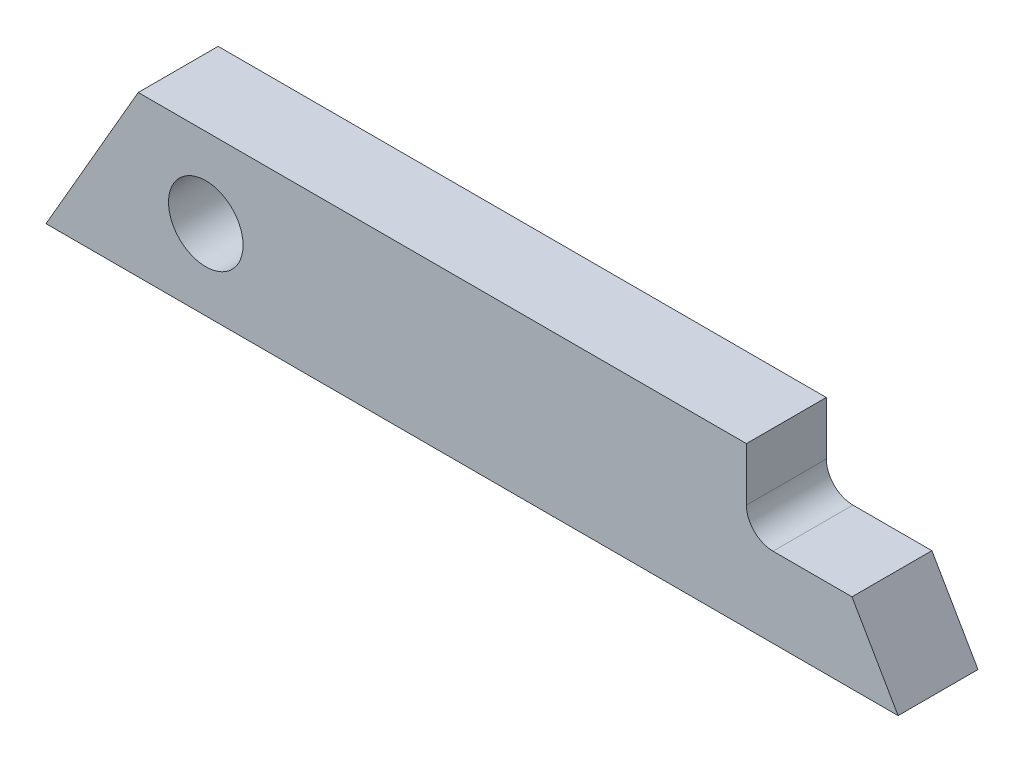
ISO-10303-21;
HEADER;
FILE_DESCRIPTION(('STEP AP214'),'2;1');
FILE_NAME('part.step','',(''),(''),'','','');
FILE_SCHEMA(('AUTOMOTIVE_DESIGN { 1 0 10303 214 1 1 1 1 }'));
ENDSEC;
DATA;
#1=APPLICATION_CONTEXT('core data for automotive mechanical design processes');
#2=APPLICATION_PROTOCOL_DEFINITION('international standard','automotive_design',2000,#1);
#3=PRODUCT_CONTEXT('',#1,'mechanical');
#4=PRODUCT('Part','Part','',(#3));
#5=PRODUCT_RELATED_PRODUCT_CATEGORY('part','',(#4));
#6=PRODUCT_DEFINITION_FORMATION('','',#4);
#7=PRODUCT_DEFINITION_CONTEXT('part definition',#1,'design');
#8=PRODUCT_DEFINITION('design','',#6,#7);
#9=PRODUCT_DEFINITION_SHAPE('','',#8);
#10=(LENGTH_UNIT() NAMED_UNIT(*) SI_UNIT(.MILLI.,.METRE.));
#11=(NAMED_UNIT(*) PLANE_ANGLE_UNIT() SI_UNIT($,.RADIAN.));
#12=(NAMED_UNIT(*) SI_UNIT($,.STERADIAN.) SOLID_ANGLE_UNIT());
#13=UNCERTAINTY_MEASURE_WITH_UNIT(LENGTH_MEASURE(1.E-05),#10,'distance_accuracy_value','');
#14=(GEOMETRIC_REPRESENTATION_CONTEXT(3) GLOBAL_UNCERTAINTY_ASSIGNED_CONTEXT((#13)) GLOBAL_UNIT_ASSIGNED_CONTEXT((#10,
#11,#12)) REPRESENTATION_CONTEXT('',''));
#15=CARTESIAN_POINT('',(0.,0.,0.));
#16=DIRECTION('',(0.,0.,1.));
#17=DIRECTION('',(1.,0.,0.));
#18=AXIS2_PLACEMENT_3D('',#15,#16,#17);
#19=CARTESIAN_POINT('',(80.,15.,15.));
#20=DIRECTION('',(0.,1.,0.));
#21=DIRECTION('',(0.,0.,1.));
#22=AXIS2_PLACEMENT_3D('',#19,#20,#21);
#23=PLANE('',#22);
#24=DIRECTION('',(1.,0.,0.));
#25=VECTOR('',#24,1.);
#26=CARTESIAN_POINT('',(80.,15.,0.));
#27=LINE('',#26,#25);
#28=CARTESIAN_POINT('',(136.514794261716,15.,0.));
#29=VERTEX_POINT('',#28);
#30=CARTESIAN_POINT('',(151.339745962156,15.,0.));
#31=VERTEX_POINT('',#30);
#32=EDGE_CURVE('E122',#29,#31,#27,.T.);
#33=ORIENTED_EDGE('',*,*,#32,.F.);
#34=DIRECTION('',(0.,0.,-1.));
#35=VECTOR('',#34,1.);
#36=CARTESIAN_POINT('',(136.514794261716,15.,15.));
#37=LINE('',#36,#35);
#38=CARTESIAN_POINT('',(136.514794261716,15.,15.));
#39=VERTEX_POINT('',#38);
#40=EDGE_CURVE('E11',#39,#29,#37,.T.);
#41=ORIENTED_EDGE('',*,*,#40,.F.);
#42=DIRECTION('',(1.,0.,0.));
#43=VECTOR('',#42,1.);
#44=CARTESIAN_POINT('',(80.,15.,15.));
#45=LINE('',#44,#43);
#46=CARTESIAN_POINT('',(151.339745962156,15.,15.));
#47=VERTEX_POINT('',#46);
#48=EDGE_CURVE('E140',#39,#47,#45,.T.);
#49=ORIENTED_EDGE('',*,*,#48,.T.);
#50=DIRECTION('',(0.,0.,-1.));
#51=VECTOR('',#50,1.);
#52=CARTESIAN_POINT('',(151.339745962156,15.,15.));
#53=LINE('',#52,#51);
#54=EDGE_CURVE('E82',#47,#31,#53,.T.);
#55=ORIENTED_EDGE('',*,*,#54,.T.);
#56=EDGE_LOOP('',(#33,#41,#49,#55));
#57=FACE_BOUND('',#56,.T.);
#58=ADVANCED_FACE('F35',(#57),#23,.T.);
#59=CARTESIAN_POINT('',(136.514794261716,20.0000000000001,15.));
#60=DIRECTION('',(0.,0.,-1.));
#61=DIRECTION('',(-1.,0.,0.));
#62=AXIS2_PLACEMENT_3D('',#59,#60,#61);
#63=CYLINDRICAL_SURFACE('',#62,5.00000000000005);
#64=CARTESIAN_POINT('',(136.514794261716,20.0000000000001,0.));
#65=DIRECTION('',(0.,0.,1.));
#66=DIRECTION('',(1.,0.,0.));
#67=AXIS2_PLACEMENT_3D('',#64,#65,#66);
#68=CIRCLE('',#67,5.00000000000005);
#69=CARTESIAN_POINT('',(131.514794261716,20.0000000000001,0.));
#70=VERTEX_POINT('',#69);
#71=EDGE_CURVE('E125',#70,#29,#68,.T.);
#72=ORIENTED_EDGE('',*,*,#71,.F.);
#73=DIRECTION('',(0.,0.,-1.));
#74=VECTOR('',#73,1.);
#75=CARTESIAN_POINT('',(131.514794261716,20.0000000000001,15.));
#76=LINE('',#75,#74);
#77=CARTESIAN_POINT('',(131.514794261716,20.0000000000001,15.));
#78=VERTEX_POINT('',#77);
#79=EDGE_CURVE('E43',#78,#70,#76,.T.);
#80=ORIENTED_EDGE('',*,*,#79,.F.);
#81=CARTESIAN_POINT('',(136.514794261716,20.0000000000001,15.));
#82=DIRECTION('',(0.,0.,1.));
#83=DIRECTION('',(1.,0.,0.));
#84=AXIS2_PLACEMENT_3D('',#81,#82,#83);
#85=CIRCLE('',#84,5.00000000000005);
#86=EDGE_CURVE('E160',#78,#39,#85,.T.);
#87=ORIENTED_EDGE('',*,*,#86,.T.);
#88=ORIENTED_EDGE('',*,*,#40,.T.);
#89=EDGE_LOOP('',(#72,#80,#87,#88));
#90=FACE_BOUND('',#89,.T.);
#91=ADVANCED_FACE('F154',(#90),#63,.F.);
#92=CARTESIAN_POINT('',(131.514794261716,-111.760930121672,15.));
#93=DIRECTION('',(1.,0.,0.));
#94=DIRECTION('',(0.,1.,0.));
#95=AXIS2_PLACEMENT_3D('',#92,#93,#94);
#96=PLANE('',#95);
#97=DIRECTION('',(0.,-1.,0.));
#98=VECTOR('',#97,1.);
#99=CARTESIAN_POINT('',(131.514794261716,-111.760930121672,0.));
#100=LINE('',#99,#98);
#101=CARTESIAN_POINT('',(131.514794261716,30.0000000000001,0.));
#102=VERTEX_POINT('',#101);
#103=EDGE_CURVE('E129',#102,#70,#100,.T.);
#104=ORIENTED_EDGE('',*,*,#103,.F.);
#105=DIRECTION('',(0.,0.,-1.));
#106=VECTOR('',#105,1.);
#107=CARTESIAN_POINT('',(131.514794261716,30.0000000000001,15.));
#108=LINE('',#107,#106);
#109=CARTESIAN_POINT('',(131.514794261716,30.0000000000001,15.));
#110=VERTEX_POINT('',#109);
#111=EDGE_CURVE('E144',#110,#102,#108,.T.);
#112=ORIENTED_EDGE('',*,*,#111,.F.);
#113=DIRECTION('',(0.,-1.,0.));
#114=VECTOR('',#113,1.);
#115=CARTESIAN_POINT('',(131.514794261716,-111.760930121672,15.));
#116=LINE('',#115,#114);
#117=EDGE_CURVE('E150',#110,#78,#116,.T.);
#118=ORIENTED_EDGE('',*,*,#117,.T.);
#119=ORIENTED_EDGE('',*,*,#79,.T.);
#120=EDGE_LOOP('',(#104,#112,#118,#119));
#121=FACE_BOUND('',#120,.T.);
#122=ADVANCED_FACE('F149',(#121),#96,.T.);
#123=CARTESIAN_POINT('',(79.9999999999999,30.,15.));
#124=DIRECTION('',(0.,1.,0.));
#125=DIRECTION('',(-1.,0.,0.));
#126=AXIS2_PLACEMENT_3D('',#123,#124,#125);
#127=PLANE('',#126);
#128=DIRECTION('',(1.,0.,0.));
#129=VECTOR('',#128,1.);
#130=CARTESIAN_POINT('',(79.9999999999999,30.,0.));
#131=LINE('',#130,#129);
#132=CARTESIAN_POINT('',(17.320508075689,30.,0.));
#133=VERTEX_POINT('',#132);
#134=EDGE_CURVE('E132',#133,#102,#131,.T.);
#135=ORIENTED_EDGE('',*,*,#134,.F.);
#136=DIRECTION('',(0.,0.,-1.));
#137=VECTOR('',#136,1.);
#138=CARTESIAN_POINT('',(17.320508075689,30.,15.));
#139=LINE('',#138,#137);
#140=CARTESIAN_POINT('',(17.320508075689,30.,15.));
#141=VERTEX_POINT('',#140);
#142=EDGE_CURVE('E115',#141,#133,#139,.T.);
#143=ORIENTED_EDGE('',*,*,#142,.F.);
#144=DIRECTION('',(1.,0.,0.));
#145=VECTOR('',#144,1.);
#146=CARTESIAN_POINT('',(79.9999999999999,30.,15.));
#147=LINE('',#146,#145);
#148=EDGE_CURVE('E104',#141,#110,#147,.T.);
#149=ORIENTED_EDGE('',*,*,#148,.T.);
#150=ORIENTED_EDGE('',*,*,#111,.T.);
#151=EDGE_LOOP('',(#135,#143,#149,#150));
#152=FACE_BOUND('',#151,.T.);
#153=ADVANCED_FACE('F159',(#152),#127,.T.);
#154=CARTESIAN_POINT('',(-28.3939023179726,-49.1796814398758,15.));
#155=DIRECTION('',(0.866025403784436,-0.500000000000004,0.));
#156=DIRECTION('',(0.500000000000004,0.866025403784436,0.));
#157=AXIS2_PLACEMENT_3D('',#154,#155,#156);
#158=PLANE('',#157);
#159=DIRECTION('',(-0.500000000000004,-0.866025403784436,0.));
#160=VECTOR('',#159,1.);
#161=CARTESIAN_POINT('',(-28.3939023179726,-49.1796814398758,0.));
#162=LINE('',#161,#160);
#163=CARTESIAN_POINT('',(0.,0.,0.));
#164=VERTEX_POINT('',#163);
#165=EDGE_CURVE('E111',#133,#164,#162,.T.);
#166=ORIENTED_EDGE('',*,*,#165,.T.);
#167=DIRECTION('',(0.,0.,-1.));
#168=VECTOR('',#167,1.);
#169=CARTESIAN_POINT('',(0.,0.,15.));
#170=LINE('',#169,#168);
#171=CARTESIAN_POINT('',(0.,0.,15.));
#172=VERTEX_POINT('',#171);
#173=EDGE_CURVE('E108',#172,#164,#170,.T.);
#174=ORIENTED_EDGE('',*,*,#173,.F.);
#175=DIRECTION('',(-0.500000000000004,-0.866025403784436,0.));
#176=VECTOR('',#175,1.);
#177=CARTESIAN_POINT('',(-28.3939023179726,-49.1796814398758,15.));
#178=LINE('',#177,#176);
#179=EDGE_CURVE('E97',#141,#172,#178,.T.);
#180=ORIENTED_EDGE('',*,*,#179,.F.);
#181=ORIENTED_EDGE('',*,*,#142,.T.);
#182=EDGE_LOOP('',(#166,#174,#180,#181));
#183=FACE_BOUND('',#182,.T.);
#184=ADVANCED_FACE('F109',(#183),#158,.F.);
#185=CARTESIAN_POINT('',(80.,0.,15.));
#186=DIRECTION('',(0.,-1.,0.));
#187=DIRECTION('',(1.,0.,0.));
#188=AXIS2_PLACEMENT_3D('',#185,#186,#187);
#189=PLANE('',#188);
#190=DIRECTION('',(-1.,0.,0.));
#191=VECTOR('',#190,1.);
#192=CARTESIAN_POINT('',(80.,0.,0.));
#193=LINE('',#192,#191);
#194=CARTESIAN_POINT('',(160.,0.,0.));
#195=VERTEX_POINT('',#194);
#196=EDGE_CURVE('E136',#195,#164,#193,.T.);
#197=ORIENTED_EDGE('',*,*,#196,.F.);
#198=DIRECTION('',(0.,0.,-1.));
#199=VECTOR('',#198,1.);
#200=CARTESIAN_POINT('',(160.,0.,15.));
#201=LINE('',#200,#199);
#202=CARTESIAN_POINT('',(160.,0.,15.));
#203=VERTEX_POINT('',#202);
#204=EDGE_CURVE('E75',#203,#195,#201,.T.);
#205=ORIENTED_EDGE('',*,*,#204,.F.);
#206=DIRECTION('',(-1.,0.,0.));
#207=VECTOR('',#206,1.);
#208=CARTESIAN_POINT('',(80.,0.,15.));
#209=LINE('',#208,#207);
#210=EDGE_CURVE('E101',#203,#172,#209,.T.);
#211=ORIENTED_EDGE('',*,*,#210,.T.);
#212=ORIENTED_EDGE('',*,*,#173,.T.);
#213=EDGE_LOOP('',(#197,#205,#211,#212));
#214=FACE_BOUND('',#213,.T.);
#215=ADVANCED_FACE('F117',(#214),#189,.T.);
#216=CARTESIAN_POINT('',(188.393902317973,-49.1796814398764,15.));
#217=DIRECTION('',(-0.866025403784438,-0.5,0.));
#218=DIRECTION('',(0.5,-0.866025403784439,0.));
#219=AXIS2_PLACEMENT_3D('',#216,#217,#218);
#220=PLANE('',#219);
#221=DIRECTION('',(-0.5,0.866025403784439,0.));
#222=VECTOR('',#221,1.);
#223=CARTESIAN_POINT('',(188.393902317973,-49.1796814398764,0.));
#224=LINE('',#223,#222);
#225=EDGE_CURVE('E138',#195,#31,#224,.T.);
#226=ORIENTED_EDGE('',*,*,#225,.T.);
#227=ORIENTED_EDGE('',*,*,#54,.F.);
#228=DIRECTION('',(-0.5,0.866025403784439,0.));
#229=VECTOR('',#228,1.);
#230=CARTESIAN_POINT('',(188.393902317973,-49.1796814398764,15.));
#231=LINE('',#230,#229);
#232=EDGE_CURVE('E51',#203,#47,#231,.T.);
#233=ORIENTED_EDGE('',*,*,#232,.F.);
#234=ORIENTED_EDGE('',*,*,#204,.T.);
#235=EDGE_LOOP('',(#226,#227,#233,#234));
#236=FACE_BOUND('',#235,.T.);
#237=ADVANCED_FACE('F174',(#236),#220,.F.);
#238=CARTESIAN_POINT('',(80.,-111.760930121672,15.));
#239=DIRECTION('',(0.,0.,1.));
#240=DIRECTION('',(1.,0.,0.));
#241=AXIS2_PLACEMENT_3D('',#238,#239,#240);
#242=PLANE('',#241);
#243=CARTESIAN_POINT('',(30.,15.,15.));
#244=DIRECTION('',(0.,0.,1.));
#245=DIRECTION('',(1.,0.,0.));
#246=AXIS2_PLACEMENT_3D('',#243,#244,#245);
#247=CIRCLE('',#246,6.99999999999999);
#248=CARTESIAN_POINT('',(37.,15.,15.));
#249=VERTEX_POINT('',#248);
#250=EDGE_CURVE('E167',#249,#249,#247,.T.);
#251=ORIENTED_EDGE('',*,*,#250,.F.);
#252=EDGE_LOOP('',(#251));
#253=FACE_BOUND('',#252,.T.);
#254=ORIENTED_EDGE('',*,*,#48,.F.);
#255=ORIENTED_EDGE('',*,*,#86,.F.);
#256=ORIENTED_EDGE('',*,*,#117,.F.);
#257=ORIENTED_EDGE('',*,*,#148,.F.);
#258=ORIENTED_EDGE('',*,*,#179,.T.);
#259=ORIENTED_EDGE('',*,*,#210,.F.);
#260=ORIENTED_EDGE('',*,*,#232,.T.);
#261=EDGE_LOOP('',(#254,#255,#256,#257,#258,#259,#260));
#262=FACE_BOUND('',#261,.T.);
#263=ADVANCED_FACE('F99',(#253,#262),#242,.T.);
#264=CARTESIAN_POINT('',(80.,-111.760930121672,0.));
#265=DIRECTION('',(0.,0.,1.));
#266=DIRECTION('',(1.,0.,0.));
#267=AXIS2_PLACEMENT_3D('',#264,#265,#266);
#268=PLANE('',#267);
#269=CARTESIAN_POINT('',(30.,15.,0.));
#270=DIRECTION('',(0.,0.,1.));
#271=DIRECTION('',(1.,0.,0.));
#272=AXIS2_PLACEMENT_3D('',#269,#270,#271);
#273=CIRCLE('',#272,6.99999999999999);
#274=CARTESIAN_POINT('',(37.,15.,0.));
#275=VERTEX_POINT('',#274);
#276=EDGE_CURVE('E126',#275,#275,#273,.T.);
#277=ORIENTED_EDGE('',*,*,#276,.T.);
#278=EDGE_LOOP('',(#277));
#279=FACE_BOUND('',#278,.T.);
#280=ORIENTED_EDGE('',*,*,#32,.T.);
#281=ORIENTED_EDGE('',*,*,#225,.F.);
#282=ORIENTED_EDGE('',*,*,#196,.T.);
#283=ORIENTED_EDGE('',*,*,#165,.F.);
#284=ORIENTED_EDGE('',*,*,#134,.T.);
#285=ORIENTED_EDGE('',*,*,#103,.T.);
#286=ORIENTED_EDGE('',*,*,#71,.T.);
#287=EDGE_LOOP('',(#280,#281,#282,#283,#284,#285,#286));
#288=FACE_BOUND('',#287,.T.);
#289=ADVANCED_FACE('F156',(#279,#288),#268,.F.);
#290=CARTESIAN_POINT('',(30.,15.,15.));
#291=DIRECTION('',(0.,0.,1.));
#292=DIRECTION('',(1.,0.,0.));
#293=AXIS2_PLACEMENT_3D('',#290,#291,#292);
#294=CYLINDRICAL_SURFACE('',#293,6.99999999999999);
#295=ORIENTED_EDGE('',*,*,#276,.F.);
#296=EDGE_LOOP('',(#295));
#297=FACE_BOUND('',#296,.T.);
#298=ORIENTED_EDGE('',*,*,#250,.T.);
#299=EDGE_LOOP('',(#298));
#300=FACE_BOUND('',#299,.T.);
#301=ADVANCED_FACE('F171',(#297,#300),#294,.F.);
#302=CLOSED_SHELL('',(#58,#91,#122,#153,#184,#215,#237,#263,#289,#301));
#303=MANIFOLD_SOLID_BREP('B2',#302);
#304=ADVANCED_BREP_SHAPE_REPRESENTATION('',(#18,#303),#14);
#305=SHAPE_DEFINITION_REPRESENTATION(#9,#304);
ENDSEC;
END-ISO-10303-21;
